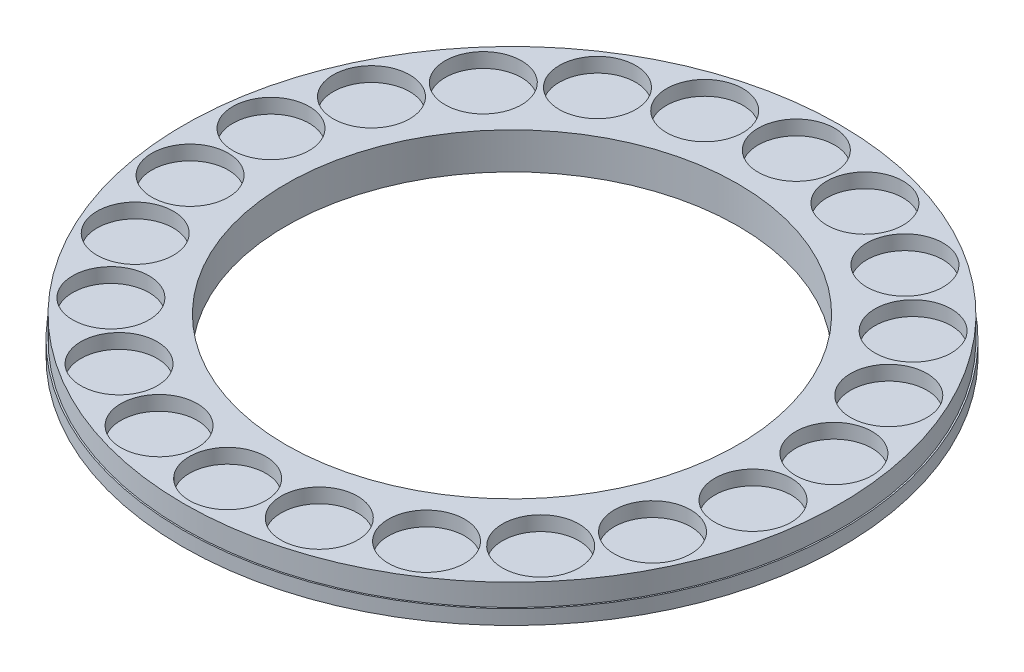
ISO-10303-21;
HEADER;
FILE_DESCRIPTION(('STEP AP214'),'2;1');
FILE_NAME('part.step','',(''),(''),'','','');
FILE_SCHEMA(('AUTOMOTIVE_DESIGN { 1 0 10303 214 1 1 1 1 }'));
ENDSEC;
DATA;
#1=APPLICATION_CONTEXT('core data for automotive mechanical design processes');
#2=APPLICATION_PROTOCOL_DEFINITION('international standard','automotive_design',2000,#1);
#3=PRODUCT_CONTEXT('',#1,'mechanical');
#4=PRODUCT('Part','Part','',(#3));
#5=PRODUCT_RELATED_PRODUCT_CATEGORY('part','',(#4));
#6=PRODUCT_DEFINITION_FORMATION('','',#4);
#7=PRODUCT_DEFINITION_CONTEXT('part definition',#1,'design');
#8=PRODUCT_DEFINITION('design','',#6,#7);
#9=PRODUCT_DEFINITION_SHAPE('','',#8);
#10=(LENGTH_UNIT() NAMED_UNIT(*) SI_UNIT(.MILLI.,.METRE.));
#11=(NAMED_UNIT(*) PLANE_ANGLE_UNIT() SI_UNIT($,.RADIAN.));
#12=(NAMED_UNIT(*) SI_UNIT($,.STERADIAN.) SOLID_ANGLE_UNIT());
#13=UNCERTAINTY_MEASURE_WITH_UNIT(LENGTH_MEASURE(1.E-05),#10,'distance_accuracy_value','');
#14=(GEOMETRIC_REPRESENTATION_CONTEXT(3) GLOBAL_UNCERTAINTY_ASSIGNED_CONTEXT((#13)) GLOBAL_UNIT_ASSIGNED_CONTEXT((#10,
#11,#12)) REPRESENTATION_CONTEXT('',''));
#15=CARTESIAN_POINT('',(0.,0.,0.));
#16=DIRECTION('',(0.,0.,1.));
#17=DIRECTION('',(1.,0.,0.));
#18=AXIS2_PLACEMENT_3D('',#15,#16,#17);
#19=CARTESIAN_POINT('',(0.,19.05,0.));
#20=DIRECTION('',(0.,-1.,0.));
#21=DIRECTION('',(0.,0.,-1.));
#22=AXIS2_PLACEMENT_3D('',#19,#20,#21);
#23=CYLINDRICAL_SURFACE('',#22,285.75);
#24=CARTESIAN_POINT('',(0.,19.05,0.));
#25=DIRECTION('',(0.,1.,0.));
#26=DIRECTION('',(0.,0.,1.));
#27=AXIS2_PLACEMENT_3D('',#24,#25,#26);
#28=CIRCLE('',#27,285.75);
#29=CARTESIAN_POINT('',(0.,19.05,-285.75));
#30=VERTEX_POINT('',#29);
#31=EDGE_CURVE('E10',#30,#30,#28,.T.);
#32=CARTESIAN_POINT('',(0.,0.,0.));
#33=DIRECTION('',(0.,-1.,0.));
#34=DIRECTION('',(0.,0.,-1.));
#35=AXIS2_PLACEMENT_3D('',#32,#33,#34);
#36=CIRCLE('',#35,285.75);
#37=CARTESIAN_POINT('',(0.,0.,-285.75));
#38=VERTEX_POINT('',#37);
#39=EDGE_CURVE('E30',#38,#38,#36,.T.);
#40=CARTESIAN_POINT('',(0.,19.05,-285.75));
#41=CARTESIAN_POINT('',(0.,18.8515625,-285.75));
#42=CARTESIAN_POINT('',(0.,18.653125,-285.75));
#43=CARTESIAN_POINT('',(0.,18.25625,-285.75));
#44=CARTESIAN_POINT('',(0.,18.0578125,-285.75));
#45=CARTESIAN_POINT('',(0.,17.6609375,-285.75));
#46=CARTESIAN_POINT('',(0.,17.4625,-285.75));
#47=CARTESIAN_POINT('',(0.,17.065625,-285.75));
#48=CARTESIAN_POINT('',(0.,16.8671875,-285.75));
#49=CARTESIAN_POINT('',(0.,16.4703125,-285.75));
#50=CARTESIAN_POINT('',(0.,16.271875,-285.75));
#51=CARTESIAN_POINT('',(0.,15.875,-285.75));
#52=CARTESIAN_POINT('',(0.,15.6765625,-285.75));
#53=CARTESIAN_POINT('',(0.,15.2796875,-285.75));
#54=CARTESIAN_POINT('',(0.,15.08125,-285.75));
#55=CARTESIAN_POINT('',(0.,14.684375,-285.75));
#56=CARTESIAN_POINT('',(0.,14.4859375,-285.75));
#57=CARTESIAN_POINT('',(0.,14.0890625,-285.75));
#58=CARTESIAN_POINT('',(0.,13.890625,-285.75));
#59=CARTESIAN_POINT('',(0.,13.49375,-285.75));
#60=CARTESIAN_POINT('',(0.,13.2953125,-285.75));
#61=CARTESIAN_POINT('',(0.,12.8984375,-285.75));
#62=CARTESIAN_POINT('',(0.,12.7,-285.75));
#63=CARTESIAN_POINT('',(0.,12.303125,-285.75));
#64=CARTESIAN_POINT('',(0.,12.1046875,-285.75));
#65=CARTESIAN_POINT('',(0.,11.7078125,-285.75));
#66=CARTESIAN_POINT('',(0.,11.509375,-285.75));
#67=CARTESIAN_POINT('',(0.,11.1125,-285.75));
#68=CARTESIAN_POINT('',(0.,10.9140625,-285.75));
#69=CARTESIAN_POINT('',(0.,10.5171875,-285.75));
#70=CARTESIAN_POINT('',(0.,10.31875,-285.75));
#71=CARTESIAN_POINT('',(0.,9.921875,-285.75));
#72=CARTESIAN_POINT('',(0.,9.7234375,-285.75));
#73=CARTESIAN_POINT('',(0.,9.3265625,-285.75));
#74=CARTESIAN_POINT('',(0.,9.128125,-285.75));
#75=CARTESIAN_POINT('',(0.,8.73125,-285.75));
#76=CARTESIAN_POINT('',(0.,8.5328125,-285.75));
#77=CARTESIAN_POINT('',(0.,8.1359375,-285.75));
#78=CARTESIAN_POINT('',(0.,7.9375,-285.75));
#79=CARTESIAN_POINT('',(0.,7.540625,-285.75));
#80=CARTESIAN_POINT('',(0.,7.3421875,-285.75));
#81=CARTESIAN_POINT('',(0.,6.9453125,-285.75));
#82=CARTESIAN_POINT('',(0.,6.746875,-285.75));
#83=CARTESIAN_POINT('',(0.,6.35,-285.75));
#84=CARTESIAN_POINT('',(0.,6.1515625,-285.75));
#85=CARTESIAN_POINT('',(0.,5.7546875,-285.75));
#86=CARTESIAN_POINT('',(0.,5.55625,-285.75));
#87=CARTESIAN_POINT('',(0.,5.159375,-285.75));
#88=CARTESIAN_POINT('',(0.,4.9609375,-285.75));
#89=CARTESIAN_POINT('',(0.,4.5640625,-285.75));
#90=CARTESIAN_POINT('',(0.,4.365625,-285.75));
#91=CARTESIAN_POINT('',(0.,3.96875,-285.75));
#92=CARTESIAN_POINT('',(0.,3.7703125,-285.75));
#93=CARTESIAN_POINT('',(0.,3.3734375,-285.75));
#94=CARTESIAN_POINT('',(0.,3.175,-285.75));
#95=CARTESIAN_POINT('',(0.,2.778125,-285.75));
#96=CARTESIAN_POINT('',(0.,2.5796875,-285.75));
#97=CARTESIAN_POINT('',(0.,2.1828125,-285.75));
#98=CARTESIAN_POINT('',(0.,1.984375,-285.75));
#99=CARTESIAN_POINT('',(0.,1.5875,-285.75));
#100=CARTESIAN_POINT('',(0.,1.3890625,-285.75));
#101=CARTESIAN_POINT('',(0.,0.992187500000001,-285.75));
#102=CARTESIAN_POINT('',(0.,0.793750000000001,-285.75));
#103=CARTESIAN_POINT('',(0.,0.396875,-285.75));
#104=CARTESIAN_POINT('',(0.,0.1984375,-285.75));
#105=CARTESIAN_POINT('',(0.,0.,-285.75));
#106=B_SPLINE_CURVE_WITH_KNOTS('',3,(#40,#41,#42,#43,#44,#45,#46,#47,#48,#49,#50,#51,#52,#53,
#54,#55,#56,#57,#58,#59,#60,#61,#62,#63,#64,#65,#66,#67,#68,#69,#70,#71,#72,#73,#74,#75,#76,#77,
#78,#79,#80,#81,#82,#83,#84,#85,#86,#87,#88,#89,#90,#91,#92,#93,#94,#95,#96,#97,#98,#99,#100,
#101,#102,#103,#104,#105),.UNSPECIFIED.,.F.,.F.,(4,2,2,2,2,2,2,2,2,2,2,2,2,2,2,2,2,2,2,2,2,2,2,
2,2,2,2,2,2,2,2,2,4),(0.,0.5953125,1.190625,1.7859375,2.38125,2.9765625,3.571875,4.1671875,
4.7625,5.3578125,5.953125,6.5484375,7.14375,7.7390625,8.334375,8.9296875,9.525,10.1203125,
10.715625,11.3109375,11.90625,12.5015625,13.096875,13.6921875,14.2875,14.8828125,15.478125,
16.0734375,16.66875,17.2640625,17.859375,18.4546875,19.05),.UNSPECIFIED.);
#107=EDGE_CURVE('BSEAM24',#30,#38,#106,.T.);
#108=ORIENTED_EDGE('',*,*,#31,.F.);
#109=ORIENTED_EDGE('',*,*,#39,.F.);
#110=ORIENTED_EDGE('',*,*,#107,.T.);
#111=ORIENTED_EDGE('',*,*,#107,.F.);
#112=EDGE_LOOP('',(#108,#110,#109,#111));
#113=FACE_BOUND('',#112,.T.);
#114=ADVANCED_FACE('F24',(#113),#23,.T.);
#115=CARTESIAN_POINT('',(0.,19.05,0.));
#116=DIRECTION('',(0.,1.,0.));
#117=DIRECTION('',(0.,0.,1.));
#118=AXIS2_PLACEMENT_3D('',#115,#116,#117);
#119=PLANE('',#118);
#120=CARTESIAN_POINT('',(0.,19.05,0.));
#121=DIRECTION('',(0.,1.,0.));
#122=DIRECTION('',(0.,0.,1.));
#123=AXIS2_PLACEMENT_3D('',#120,#121,#122);
#124=CIRCLE('',#123,196.85);
#125=CARTESIAN_POINT('',(0.,19.05,196.85));
#126=VERTEX_POINT('',#125);
#127=EDGE_CURVE('E178',#126,#126,#124,.T.);
#128=ORIENTED_EDGE('',*,*,#127,.F.);
#129=EDGE_LOOP('',(#128));
#130=FACE_BOUND('',#129,.T.);
#131=CARTESIAN_POINT('',(-69.7710677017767,19.05,237.618434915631));
#132=DIRECTION('',(0.,1.,0.));
#133=DIRECTION('',(-0.281732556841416,0.,0.959492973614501));
#134=AXIS2_PLACEMENT_3D('',#131,#132,#133);
#135=CIRCLE('',#134,33.274);
#136=CARTESIAN_POINT('',(-79.145436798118,19.05,269.54460411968));
#137=VERTEX_POINT('',#136);
#138=EDGE_CURVE('E172',#137,#137,#135,.T.);
#139=ORIENTED_EDGE('',*,*,#138,.F.);
#140=EDGE_LOOP('',(#139));
#141=FACE_BOUND('',#140,.T.);
#142=CARTESIAN_POINT('',(-133.889698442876,19.05,208.336437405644));
#143=DIRECTION('',(0.,1.,0.));
#144=DIRECTION('',(-0.540640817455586,0.,0.841253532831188));
#145=AXIS2_PLACEMENT_3D('',#142,#143,#144);
#146=CIRCLE('',#145,33.274);
#147=CARTESIAN_POINT('',(-151.878981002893,19.05,236.328307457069));
#148=VERTEX_POINT('',#147);
#149=EDGE_CURVE('E166',#148,#148,#146,.T.);
#150=ORIENTED_EDGE('',*,*,#149,.F.);
#151=EDGE_LOOP('',(#150));
#152=FACE_BOUND('',#151,.T.);
#153=CARTESIAN_POINT('',(-187.16138208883,19.05,162.176260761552));
#154=DIRECTION('',(0.,1.,0.));
#155=DIRECTION('',(-0.75574957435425,0.,0.654860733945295));
#156=AXIS2_PLACEMENT_3D('',#153,#154,#155);
#157=CIRCLE('',#156,33.274);
#158=CARTESIAN_POINT('',(-212.308193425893,19.05,183.966096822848));
#159=VERTEX_POINT('',#158);
#160=EDGE_CURVE('E160',#159,#159,#157,.T.);
#161=ORIENTED_EDGE('',*,*,#160,.F.);
#162=EDGE_LOOP('',(#161));
#163=FACE_BOUND('',#162,.T.);
#164=CARTESIAN_POINT('',(-225.270363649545,19.05,102.87752796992));
#165=DIRECTION('',(0.,1.,0.));
#166=DIRECTION('',(-0.909631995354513,0.,0.415415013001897));
#167=AXIS2_PLACEMENT_3D('',#164,#165,#166);
#168=CIRCLE('',#167,33.274);
#169=CARTESIAN_POINT('',(-255.537458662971,19.05,116.700047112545));
#170=VERTEX_POINT('',#169);
#171=EDGE_CURVE('E154',#170,#170,#168,.T.);
#172=ORIENTED_EDGE('',*,*,#171,.F.);
#173=EDGE_LOOP('',(#172));
#174=FACE_BOUND('',#173,.T.);
#175=CARTESIAN_POINT('',(-245.129280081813,19.05,35.2442696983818));
#176=DIRECTION('',(0.,1.,0.));
#177=DIRECTION('',(-0.989821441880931,0.,0.142314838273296));
#178=AXIS2_PLACEMENT_3D('',#175,#176,#177);
#179=CIRCLE('',#178,33.274);
#180=CARTESIAN_POINT('',(-278.064598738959,19.05,39.9796536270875));
#181=VERTEX_POINT('',#180);
#182=EDGE_CURVE('E148',#181,#181,#179,.T.);
#183=ORIENTED_EDGE('',*,*,#182,.F.);
#184=EDGE_LOOP('',(#183));
#185=FACE_BOUND('',#184,.T.);
#186=CARTESIAN_POINT('',(-245.129280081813,19.05,-35.2442696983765));
#187=DIRECTION('',(0.,1.,0.));
#188=DIRECTION('',(-0.989821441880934,0.,-0.142314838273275));
#189=AXIS2_PLACEMENT_3D('',#186,#187,#188);
#190=CIRCLE('',#189,33.274);
#191=CARTESIAN_POINT('',(-278.06459873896,19.05,-39.9796536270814));
#192=VERTEX_POINT('',#191);
#193=EDGE_CURVE('E142',#192,#192,#190,.T.);
#194=ORIENTED_EDGE('',*,*,#193,.F.);
#195=EDGE_LOOP('',(#194));
#196=FACE_BOUND('',#195,.T.);
#197=CARTESIAN_POINT('',(-225.270363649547,19.05,-102.877527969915));
#198=DIRECTION('',(0.,1.,0.));
#199=DIRECTION('',(-0.909631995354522,0.,-0.415415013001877));
#200=AXIS2_PLACEMENT_3D('',#197,#198,#199);
#201=CIRCLE('',#200,33.274);
#202=CARTESIAN_POINT('',(-255.537458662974,19.05,-116.700047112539));
#203=VERTEX_POINT('',#202);
#204=EDGE_CURVE('E136',#203,#203,#201,.T.);
#205=ORIENTED_EDGE('',*,*,#204,.F.);
#206=EDGE_LOOP('',(#205));
#207=FACE_BOUND('',#206,.T.);
#208=CARTESIAN_POINT('',(-187.161382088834,19.05,-162.176260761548));
#209=DIRECTION('',(0.,1.,0.));
#210=DIRECTION('',(-0.755749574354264,0.,-0.654860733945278));
#211=AXIS2_PLACEMENT_3D('',#208,#209,#210);
#212=CIRCLE('',#211,33.274);
#213=CARTESIAN_POINT('',(-212.308193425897,19.05,-183.966096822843));
#214=VERTEX_POINT('',#213);
#215=EDGE_CURVE('E130',#214,#214,#212,.T.);
#216=ORIENTED_EDGE('',*,*,#215,.F.);
#217=EDGE_LOOP('',(#216));
#218=FACE_BOUND('',#217,.T.);
#219=CARTESIAN_POINT('',(-133.88969844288,19.05,-208.336437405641));
#220=DIRECTION('',(0.,1.,0.));
#221=DIRECTION('',(-0.540640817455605,0.,-0.841253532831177));
#222=AXIS2_PLACEMENT_3D('',#219,#220,#221);
#223=CIRCLE('',#222,33.274);
#224=CARTESIAN_POINT('',(-151.878981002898,19.05,-236.328307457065));
#225=VERTEX_POINT('',#224);
#226=EDGE_CURVE('E124',#225,#225,#223,.T.);
#227=ORIENTED_EDGE('',*,*,#226,.F.);
#228=EDGE_LOOP('',(#227));
#229=FACE_BOUND('',#228,.T.);
#230=CARTESIAN_POINT('',(-69.7710677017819,19.05,-237.61843491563));
#231=DIRECTION('',(0.,1.,0.));
#232=DIRECTION('',(-0.281732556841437,0.,-0.959492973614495));
#233=AXIS2_PLACEMENT_3D('',#230,#231,#232);
#234=CIRCLE('',#233,33.274);
#235=CARTESIAN_POINT('',(-79.1454367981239,19.05,-269.544604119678));
#236=VERTEX_POINT('',#235);
#237=EDGE_CURVE('E118',#236,#236,#234,.T.);
#238=ORIENTED_EDGE('',*,*,#237,.F.);
#239=EDGE_LOOP('',(#238));
#240=FACE_BOUND('',#239,.T.);
#241=CARTESIAN_POINT('',(-1.83931040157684E-12,19.05,-247.65));
#242=DIRECTION('',(0.,1.,0.));
#243=DIRECTION('',(0.,0.,-1.));
#244=AXIS2_PLACEMENT_3D('',#241,#242,#243);
#245=CIRCLE('',#244,33.274);
#246=CARTESIAN_POINT('',(-2.0864382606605E-12,19.05,-280.924));
#247=VERTEX_POINT('',#246);
#248=EDGE_CURVE('E112',#247,#247,#245,.T.);
#249=ORIENTED_EDGE('',*,*,#248,.F.);
#250=EDGE_LOOP('',(#249));
#251=FACE_BOUND('',#250,.T.);
#252=CARTESIAN_POINT('',(69.7710677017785,19.05,-237.618434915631));
#253=DIRECTION('',(0.,1.,0.));
#254=DIRECTION('',(0.281732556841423,0.,-0.959492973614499));
#255=AXIS2_PLACEMENT_3D('',#252,#253,#254);
#256=CIRCLE('',#255,33.274);
#257=CARTESIAN_POINT('',(79.14543679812,19.05,-269.54460411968));
#258=VERTEX_POINT('',#257);
#259=EDGE_CURVE('E106',#258,#258,#256,.T.);
#260=ORIENTED_EDGE('',*,*,#259,.F.);
#261=EDGE_LOOP('',(#260));
#262=FACE_BOUND('',#261,.T.);
#263=CARTESIAN_POINT('',(133.889698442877,19.05,-208.336437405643));
#264=DIRECTION('',(0.,1.,0.));
#265=DIRECTION('',(0.540640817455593,0.,-0.841253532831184));
#266=AXIS2_PLACEMENT_3D('',#263,#264,#265);
#267=CIRCLE('',#266,33.274);
#268=CARTESIAN_POINT('',(151.878981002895,19.05,-236.328307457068));
#269=VERTEX_POINT('',#268);
#270=EDGE_CURVE('E100',#269,#269,#267,.T.);
#271=ORIENTED_EDGE('',*,*,#270,.F.);
#272=EDGE_LOOP('',(#271));
#273=FACE_BOUND('',#272,.T.);
#274=CARTESIAN_POINT('',(187.161382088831,19.05,-162.176260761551));
#275=DIRECTION('',(0.,1.,0.));
#276=DIRECTION('',(0.755749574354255,0.,-0.654860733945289));
#277=AXIS2_PLACEMENT_3D('',#274,#275,#276);
#278=CIRCLE('',#277,33.274);
#279=CARTESIAN_POINT('',(212.308193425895,19.05,-183.966096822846));
#280=VERTEX_POINT('',#279);
#281=EDGE_CURVE('E94',#280,#280,#278,.T.);
#282=ORIENTED_EDGE('',*,*,#281,.F.);
#283=EDGE_LOOP('',(#282));
#284=FACE_BOUND('',#283,.T.);
#285=CARTESIAN_POINT('',(225.270363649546,19.05,-102.877527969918));
#286=DIRECTION('',(0.,1.,0.));
#287=DIRECTION('',(0.909631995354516,0.,-0.415415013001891));
#288=AXIS2_PLACEMENT_3D('',#285,#286,#287);
#289=CIRCLE('',#288,33.274);
#290=CARTESIAN_POINT('',(255.537458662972,19.05,-116.700047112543));
#291=VERTEX_POINT('',#290);
#292=EDGE_CURVE('E88',#291,#291,#289,.T.);
#293=ORIENTED_EDGE('',*,*,#292,.F.);
#294=EDGE_LOOP('',(#293));
#295=FACE_BOUND('',#294,.T.);
#296=CARTESIAN_POINT('',(245.129280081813,19.05,-35.24426969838));
#297=DIRECTION('',(0.,1.,0.));
#298=DIRECTION('',(0.989821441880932,0.,-0.142314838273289));
#299=AXIS2_PLACEMENT_3D('',#296,#297,#298);
#300=CIRCLE('',#299,33.274);
#301=CARTESIAN_POINT('',(278.064598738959,19.05,-39.9796536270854));
#302=VERTEX_POINT('',#301);
#303=EDGE_CURVE('E82',#302,#302,#300,.T.);
#304=ORIENTED_EDGE('',*,*,#303,.F.);
#305=EDGE_LOOP('',(#304));
#306=FACE_BOUND('',#305,.T.);
#307=CARTESIAN_POINT('',(245.129280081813,19.05,35.2442696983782));
#308=DIRECTION('',(0.,1.,0.));
#309=DIRECTION('',(0.989821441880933,0.,0.142314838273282));
#310=AXIS2_PLACEMENT_3D('',#307,#308,#309);
#311=CIRCLE('',#310,33.274);
#312=CARTESIAN_POINT('',(278.064598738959,19.05,39.9796536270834));
#313=VERTEX_POINT('',#312);
#314=EDGE_CURVE('E76',#313,#313,#311,.T.);
#315=ORIENTED_EDGE('',*,*,#314,.F.);
#316=EDGE_LOOP('',(#315));
#317=FACE_BOUND('',#316,.T.);
#318=CARTESIAN_POINT('',(225.270363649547,19.05,102.877527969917));
#319=DIRECTION('',(0.,1.,0.));
#320=DIRECTION('',(0.909631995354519,0.,0.415415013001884));
#321=AXIS2_PLACEMENT_3D('',#318,#319,#320);
#322=CIRCLE('',#321,33.274);
#323=CARTESIAN_POINT('',(255.537458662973,19.05,116.700047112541));
#324=VERTEX_POINT('',#323);
#325=EDGE_CURVE('E70',#324,#324,#322,.T.);
#326=ORIENTED_EDGE('',*,*,#325,.F.);
#327=EDGE_LOOP('',(#326));
#328=FACE_BOUND('',#327,.T.);
#329=CARTESIAN_POINT('',(187.161382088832,19.05,162.176260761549));
#330=DIRECTION('',(0.,1.,0.));
#331=DIRECTION('',(0.755749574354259,0.,0.654860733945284));
#332=AXIS2_PLACEMENT_3D('',#329,#330,#331);
#333=CIRCLE('',#332,33.274);
#334=CARTESIAN_POINT('',(212.308193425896,19.05,183.966096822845));
#335=VERTEX_POINT('',#334);
#336=EDGE_CURVE('E64',#335,#335,#333,.T.);
#337=ORIENTED_EDGE('',*,*,#336,.F.);
#338=EDGE_LOOP('',(#337));
#339=FACE_BOUND('',#338,.T.);
#340=CARTESIAN_POINT('',(133.889698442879,19.05,208.336437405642));
#341=DIRECTION('',(0.,1.,0.));
#342=DIRECTION('',(0.540640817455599,0.,0.841253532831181));
#343=AXIS2_PLACEMENT_3D('',#340,#341,#342);
#344=CIRCLE('',#343,33.274);
#345=CARTESIAN_POINT('',(151.878981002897,19.05,236.328307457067));
#346=VERTEX_POINT('',#345);
#347=EDGE_CURVE('E58',#346,#346,#344,.T.);
#348=ORIENTED_EDGE('',*,*,#347,.F.);
#349=EDGE_LOOP('',(#348));
#350=FACE_BOUND('',#349,.T.);
#351=CARTESIAN_POINT('',(69.7710677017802,19.05,237.61843491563));
#352=DIRECTION('',(0.,1.,0.));
#353=DIRECTION('',(0.28173255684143,0.,0.959492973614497));
#354=AXIS2_PLACEMENT_3D('',#351,#352,#353);
#355=CIRCLE('',#354,33.274);
#356=CARTESIAN_POINT('',(79.145436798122,19.05,269.544604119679));
#357=VERTEX_POINT('',#356);
#358=EDGE_CURVE('E52',#357,#357,#355,.T.);
#359=ORIENTED_EDGE('',*,*,#358,.F.);
#360=EDGE_LOOP('',(#359));
#361=FACE_BOUND('',#360,.T.);
#362=CARTESIAN_POINT('',(0.,19.05,247.65));
#363=DIRECTION('',(0.,1.,0.));
#364=DIRECTION('',(0.,0.,1.));
#365=AXIS2_PLACEMENT_3D('',#362,#363,#364);
#366=CIRCLE('',#365,33.274);
#367=CARTESIAN_POINT('',(0.,19.05,280.924));
#368=VERTEX_POINT('',#367);
#369=EDGE_CURVE('E46',#368,#368,#366,.T.);
#370=ORIENTED_EDGE('',*,*,#369,.F.);
#371=EDGE_LOOP('',(#370));
#372=FACE_BOUND('',#371,.T.);
#373=ORIENTED_EDGE('',*,*,#31,.T.);
#374=EDGE_LOOP('',(#373));
#375=FACE_BOUND('',#374,.T.);
#376=ADVANCED_FACE('F184',(#130,#141,#152,#163,#174,#185,#196,#207,#218,#229,#240,#251,#262,
#273,#284,#295,#306,#317,#328,#339,#350,#361,#372,#375),#119,.T.);
#377=CARTESIAN_POINT('',(0.,0.,0.));
#378=DIRECTION('',(0.,-1.,0.));
#379=DIRECTION('',(0.,0.,-1.));
#380=AXIS2_PLACEMENT_3D('',#377,#378,#379);
#381=PLANE('',#380);
#382=CARTESIAN_POINT('',(0.,0.,0.));
#383=DIRECTION('',(0.,-1.,0.));
#384=DIRECTION('',(0.,0.,-1.));
#385=AXIS2_PLACEMENT_3D('',#382,#383,#384);
#386=CIRCLE('',#385,287.02);
#387=CARTESIAN_POINT('',(0.,0.,-287.02));
#388=VERTEX_POINT('',#387);
#389=EDGE_CURVE('E38',#388,#388,#386,.T.);
#390=ORIENTED_EDGE('',*,*,#389,.F.);
#391=EDGE_LOOP('',(#390));
#392=FACE_BOUND('',#391,.T.);
#393=ORIENTED_EDGE('',*,*,#39,.T.);
#394=EDGE_LOOP('',(#393));
#395=FACE_BOUND('',#394,.T.);
#396=ADVANCED_FACE('F187',(#392,#395),#381,.F.);
#397=CARTESIAN_POINT('',(0.,-12.7,0.));
#398=DIRECTION('',(0.,1.,0.));
#399=DIRECTION('',(0.,0.,1.));
#400=AXIS2_PLACEMENT_3D('',#397,#398,#399);
#401=CYLINDRICAL_SURFACE('',#400,287.02);
#402=CARTESIAN_POINT('',(0.,-12.7,0.));
#403=DIRECTION('',(0.,-1.,0.));
#404=DIRECTION('',(0.,0.,-1.));
#405=AXIS2_PLACEMENT_3D('',#402,#403,#404);
#406=CIRCLE('',#405,287.02);
#407=CARTESIAN_POINT('',(0.,-12.7,-287.02));
#408=VERTEX_POINT('',#407);
#409=EDGE_CURVE('E34',#408,#408,#406,.T.);
#410=ORIENTED_EDGE('',*,*,#409,.F.);
#411=EDGE_LOOP('',(#410));
#412=FACE_BOUND('',#411,.T.);
#413=ORIENTED_EDGE('',*,*,#389,.T.);
#414=EDGE_LOOP('',(#413));
#415=FACE_BOUND('',#414,.T.);
#416=ADVANCED_FACE('F246',(#412,#415),#401,.T.);
#417=CARTESIAN_POINT('',(0.,-12.7,0.));
#418=DIRECTION('',(0.,-1.,0.));
#419=DIRECTION('',(0.,0.,-1.));
#420=AXIS2_PLACEMENT_3D('',#417,#418,#419);
#421=PLANE('',#420);
#422=CARTESIAN_POINT('',(0.,-12.7,0.));
#423=DIRECTION('',(0.,1.,0.));
#424=DIRECTION('',(0.,0.,1.));
#425=AXIS2_PLACEMENT_3D('',#422,#423,#424);
#426=CIRCLE('',#425,196.85);
#427=CARTESIAN_POINT('',(0.,-12.7,196.85));
#428=VERTEX_POINT('',#427);
#429=EDGE_CURVE('E175',#428,#428,#426,.T.);
#430=ORIENTED_EDGE('',*,*,#429,.T.);
#431=EDGE_LOOP('',(#430));
#432=FACE_BOUND('',#431,.T.);
#433=ORIENTED_EDGE('',*,*,#409,.T.);
#434=EDGE_LOOP('',(#433));
#435=FACE_BOUND('',#434,.T.);
#436=ADVANCED_FACE('F235',(#432,#435),#421,.T.);
#437=CARTESIAN_POINT('',(0.,6.35,247.65));
#438=DIRECTION('',(0.,1.,0.));
#439=DIRECTION('',(0.,0.,1.));
#440=AXIS2_PLACEMENT_3D('',#437,#438,#439);
#441=CYLINDRICAL_SURFACE('',#440,33.274);
#442=CARTESIAN_POINT('',(0.,6.35,247.65));
#443=DIRECTION('',(0.,1.,0.));
#444=DIRECTION('',(0.,0.,1.));
#445=AXIS2_PLACEMENT_3D('',#442,#443,#444);
#446=CIRCLE('',#445,33.274);
#447=CARTESIAN_POINT('',(0.,6.35,280.924));
#448=VERTEX_POINT('',#447);
#449=EDGE_CURVE('E43',#448,#448,#446,.T.);
#450=ORIENTED_EDGE('',*,*,#449,.F.);
#451=EDGE_LOOP('',(#450));
#452=FACE_BOUND('',#451,.T.);
#453=ORIENTED_EDGE('',*,*,#369,.T.);
#454=EDGE_LOOP('',(#453));
#455=FACE_BOUND('',#454,.T.);
#456=ADVANCED_FACE('F232',(#452,#455),#441,.F.);
#457=CARTESIAN_POINT('',(0.,6.35,247.65));
#458=DIRECTION('',(0.,1.,0.));
#459=DIRECTION('',(0.,0.,1.));
#460=AXIS2_PLACEMENT_3D('',#457,#458,#459);
#461=PLANE('',#460);
#462=ORIENTED_EDGE('',*,*,#449,.T.);
#463=EDGE_LOOP('',(#462));
#464=FACE_BOUND('',#463,.T.);
#465=ADVANCED_FACE('F234',(#464),#461,.T.);
#466=CARTESIAN_POINT('',(69.7710677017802,6.35,237.61843491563));
#467=DIRECTION('',(0.,1.,0.));
#468=DIRECTION('',(0.,0.,1.));
#469=AXIS2_PLACEMENT_3D('',#466,#467,#468);
#470=CYLINDRICAL_SURFACE('',#469,33.274);
#471=CARTESIAN_POINT('',(69.7710677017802,6.35,237.61843491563));
#472=DIRECTION('',(0.,1.,0.));
#473=DIRECTION('',(0.28173255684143,0.,0.959492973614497));
#474=AXIS2_PLACEMENT_3D('',#471,#472,#473);
#475=CIRCLE('',#474,33.274);
#476=CARTESIAN_POINT('',(79.145436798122,6.35,269.544604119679));
#477=VERTEX_POINT('',#476);
#478=EDGE_CURVE('E49',#477,#477,#475,.T.);
#479=ORIENTED_EDGE('',*,*,#478,.F.);
#480=EDGE_LOOP('',(#479));
#481=FACE_BOUND('',#480,.T.);
#482=ORIENTED_EDGE('',*,*,#358,.T.);
#483=EDGE_LOOP('',(#482));
#484=FACE_BOUND('',#483,.T.);
#485=ADVANCED_FACE('F242',(#481,#484),#470,.F.);
#486=CARTESIAN_POINT('',(69.7710677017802,6.35,237.61843491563));
#487=DIRECTION('',(0.,1.,0.));
#488=DIRECTION('',(0.28173255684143,0.,0.959492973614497));
#489=AXIS2_PLACEMENT_3D('',#486,#487,#488);
#490=PLANE('',#489);
#491=ORIENTED_EDGE('',*,*,#478,.T.);
#492=EDGE_LOOP('',(#491));
#493=FACE_BOUND('',#492,.T.);
#494=ADVANCED_FACE('F287',(#493),#490,.T.);
#495=CARTESIAN_POINT('',(133.889698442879,6.35,208.336437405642));
#496=DIRECTION('',(0.,1.,0.));
#497=DIRECTION('',(0.,0.,1.));
#498=AXIS2_PLACEMENT_3D('',#495,#496,#497);
#499=CYLINDRICAL_SURFACE('',#498,33.274);
#500=CARTESIAN_POINT('',(133.889698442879,6.35,208.336437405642));
#501=DIRECTION('',(0.,1.,0.));
#502=DIRECTION('',(0.540640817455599,0.,0.841253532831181));
#503=AXIS2_PLACEMENT_3D('',#500,#501,#502);
#504=CIRCLE('',#503,33.274);
#505=CARTESIAN_POINT('',(151.878981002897,6.35,236.328307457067));
#506=VERTEX_POINT('',#505);
#507=EDGE_CURVE('E55',#506,#506,#504,.T.);
#508=ORIENTED_EDGE('',*,*,#507,.F.);
#509=EDGE_LOOP('',(#508));
#510=FACE_BOUND('',#509,.T.);
#511=ORIENTED_EDGE('',*,*,#347,.T.);
#512=EDGE_LOOP('',(#511));
#513=FACE_BOUND('',#512,.T.);
#514=ADVANCED_FACE('F295',(#510,#513),#499,.F.);
#515=CARTESIAN_POINT('',(133.889698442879,6.35,208.336437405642));
#516=DIRECTION('',(0.,1.,0.));
#517=DIRECTION('',(0.540640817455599,0.,0.841253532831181));
#518=AXIS2_PLACEMENT_3D('',#515,#516,#517);
#519=PLANE('',#518);
#520=ORIENTED_EDGE('',*,*,#507,.T.);
#521=EDGE_LOOP('',(#520));
#522=FACE_BOUND('',#521,.T.);
#523=ADVANCED_FACE('F303',(#522),#519,.T.);
#524=CARTESIAN_POINT('',(187.161382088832,6.35,162.176260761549));
#525=DIRECTION('',(0.,1.,0.));
#526=DIRECTION('',(0.,0.,1.));
#527=AXIS2_PLACEMENT_3D('',#524,#525,#526);
#528=CYLINDRICAL_SURFACE('',#527,33.274);
#529=CARTESIAN_POINT('',(187.161382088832,6.35,162.176260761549));
#530=DIRECTION('',(0.,1.,0.));
#531=DIRECTION('',(0.755749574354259,0.,0.654860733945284));
#532=AXIS2_PLACEMENT_3D('',#529,#530,#531);
#533=CIRCLE('',#532,33.274);
#534=CARTESIAN_POINT('',(212.308193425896,6.35,183.966096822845));
#535=VERTEX_POINT('',#534);
#536=EDGE_CURVE('E61',#535,#535,#533,.T.);
#537=ORIENTED_EDGE('',*,*,#536,.F.);
#538=EDGE_LOOP('',(#537));
#539=FACE_BOUND('',#538,.T.);
#540=ORIENTED_EDGE('',*,*,#336,.T.);
#541=EDGE_LOOP('',(#540));
#542=FACE_BOUND('',#541,.T.);
#543=ADVANCED_FACE('F311',(#539,#542),#528,.F.);
#544=CARTESIAN_POINT('',(187.161382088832,6.35,162.176260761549));
#545=DIRECTION('',(0.,1.,0.));
#546=DIRECTION('',(0.755749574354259,0.,0.654860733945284));
#547=AXIS2_PLACEMENT_3D('',#544,#545,#546);
#548=PLANE('',#547);
#549=ORIENTED_EDGE('',*,*,#536,.T.);
#550=EDGE_LOOP('',(#549));
#551=FACE_BOUND('',#550,.T.);
#552=ADVANCED_FACE('F319',(#551),#548,.T.);
#553=CARTESIAN_POINT('',(225.270363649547,6.35,102.877527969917));
#554=DIRECTION('',(0.,1.,0.));
#555=DIRECTION('',(0.,0.,1.));
#556=AXIS2_PLACEMENT_3D('',#553,#554,#555);
#557=CYLINDRICAL_SURFACE('',#556,33.274);
#558=CARTESIAN_POINT('',(225.270363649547,6.35,102.877527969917));
#559=DIRECTION('',(0.,1.,0.));
#560=DIRECTION('',(0.909631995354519,0.,0.415415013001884));
#561=AXIS2_PLACEMENT_3D('',#558,#559,#560);
#562=CIRCLE('',#561,33.274);
#563=CARTESIAN_POINT('',(255.537458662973,6.35,116.700047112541));
#564=VERTEX_POINT('',#563);
#565=EDGE_CURVE('E67',#564,#564,#562,.T.);
#566=ORIENTED_EDGE('',*,*,#565,.F.);
#567=EDGE_LOOP('',(#566));
#568=FACE_BOUND('',#567,.T.);
#569=ORIENTED_EDGE('',*,*,#325,.T.);
#570=EDGE_LOOP('',(#569));
#571=FACE_BOUND('',#570,.T.);
#572=ADVANCED_FACE('F327',(#568,#571),#557,.F.);
#573=CARTESIAN_POINT('',(225.270363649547,6.35,102.877527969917));
#574=DIRECTION('',(0.,1.,0.));
#575=DIRECTION('',(0.909631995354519,0.,0.415415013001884));
#576=AXIS2_PLACEMENT_3D('',#573,#574,#575);
#577=PLANE('',#576);
#578=ORIENTED_EDGE('',*,*,#565,.T.);
#579=EDGE_LOOP('',(#578));
#580=FACE_BOUND('',#579,.T.);
#581=ADVANCED_FACE('F335',(#580),#577,.T.);
#582=CARTESIAN_POINT('',(245.129280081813,6.35,35.2442696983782));
#583=DIRECTION('',(0.,1.,0.));
#584=DIRECTION('',(0.,0.,1.));
#585=AXIS2_PLACEMENT_3D('',#582,#583,#584);
#586=CYLINDRICAL_SURFACE('',#585,33.274);
#587=CARTESIAN_POINT('',(245.129280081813,6.35,35.2442696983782));
#588=DIRECTION('',(0.,1.,0.));
#589=DIRECTION('',(0.989821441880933,0.,0.142314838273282));
#590=AXIS2_PLACEMENT_3D('',#587,#588,#589);
#591=CIRCLE('',#590,33.274);
#592=CARTESIAN_POINT('',(278.064598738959,6.35,39.9796536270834));
#593=VERTEX_POINT('',#592);
#594=EDGE_CURVE('E73',#593,#593,#591,.T.);
#595=ORIENTED_EDGE('',*,*,#594,.F.);
#596=EDGE_LOOP('',(#595));
#597=FACE_BOUND('',#596,.T.);
#598=ORIENTED_EDGE('',*,*,#314,.T.);
#599=EDGE_LOOP('',(#598));
#600=FACE_BOUND('',#599,.T.);
#601=ADVANCED_FACE('F343',(#597,#600),#586,.F.);
#602=CARTESIAN_POINT('',(245.129280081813,6.35,35.2442696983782));
#603=DIRECTION('',(0.,1.,0.));
#604=DIRECTION('',(0.989821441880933,0.,0.142314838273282));
#605=AXIS2_PLACEMENT_3D('',#602,#603,#604);
#606=PLANE('',#605);
#607=ORIENTED_EDGE('',*,*,#594,.T.);
#608=EDGE_LOOP('',(#607));
#609=FACE_BOUND('',#608,.T.);
#610=ADVANCED_FACE('F351',(#609),#606,.T.);
#611=CARTESIAN_POINT('',(245.129280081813,6.35,-35.24426969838));
#612=DIRECTION('',(0.,1.,0.));
#613=DIRECTION('',(0.,0.,1.));
#614=AXIS2_PLACEMENT_3D('',#611,#612,#613);
#615=CYLINDRICAL_SURFACE('',#614,33.274);
#616=CARTESIAN_POINT('',(245.129280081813,6.35,-35.24426969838));
#617=DIRECTION('',(0.,1.,0.));
#618=DIRECTION('',(0.989821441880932,0.,-0.142314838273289));
#619=AXIS2_PLACEMENT_3D('',#616,#617,#618);
#620=CIRCLE('',#619,33.274);
#621=CARTESIAN_POINT('',(278.064598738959,6.35,-39.9796536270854));
#622=VERTEX_POINT('',#621);
#623=EDGE_CURVE('E79',#622,#622,#620,.T.);
#624=ORIENTED_EDGE('',*,*,#623,.F.);
#625=EDGE_LOOP('',(#624));
#626=FACE_BOUND('',#625,.T.);
#627=ORIENTED_EDGE('',*,*,#303,.T.);
#628=EDGE_LOOP('',(#627));
#629=FACE_BOUND('',#628,.T.);
#630=ADVANCED_FACE('F359',(#626,#629),#615,.F.);
#631=CARTESIAN_POINT('',(245.129280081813,6.35,-35.24426969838));
#632=DIRECTION('',(0.,1.,0.));
#633=DIRECTION('',(0.989821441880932,0.,-0.142314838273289));
#634=AXIS2_PLACEMENT_3D('',#631,#632,#633);
#635=PLANE('',#634);
#636=ORIENTED_EDGE('',*,*,#623,.T.);
#637=EDGE_LOOP('',(#636));
#638=FACE_BOUND('',#637,.T.);
#639=ADVANCED_FACE('F367',(#638),#635,.T.);
#640=CARTESIAN_POINT('',(225.270363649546,6.35,-102.877527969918));
#641=DIRECTION('',(0.,1.,0.));
#642=DIRECTION('',(0.,0.,1.));
#643=AXIS2_PLACEMENT_3D('',#640,#641,#642);
#644=CYLINDRICAL_SURFACE('',#643,33.274);
#645=CARTESIAN_POINT('',(225.270363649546,6.35,-102.877527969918));
#646=DIRECTION('',(0.,1.,0.));
#647=DIRECTION('',(0.909631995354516,0.,-0.415415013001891));
#648=AXIS2_PLACEMENT_3D('',#645,#646,#647);
#649=CIRCLE('',#648,33.274);
#650=CARTESIAN_POINT('',(255.537458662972,6.35,-116.700047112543));
#651=VERTEX_POINT('',#650);
#652=EDGE_CURVE('E85',#651,#651,#649,.T.);
#653=ORIENTED_EDGE('',*,*,#652,.F.);
#654=EDGE_LOOP('',(#653));
#655=FACE_BOUND('',#654,.T.);
#656=ORIENTED_EDGE('',*,*,#292,.T.);
#657=EDGE_LOOP('',(#656));
#658=FACE_BOUND('',#657,.T.);
#659=ADVANCED_FACE('F375',(#655,#658),#644,.F.);
#660=CARTESIAN_POINT('',(225.270363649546,6.35,-102.877527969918));
#661=DIRECTION('',(0.,1.,0.));
#662=DIRECTION('',(0.909631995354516,0.,-0.415415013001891));
#663=AXIS2_PLACEMENT_3D('',#660,#661,#662);
#664=PLANE('',#663);
#665=ORIENTED_EDGE('',*,*,#652,.T.);
#666=EDGE_LOOP('',(#665));
#667=FACE_BOUND('',#666,.T.);
#668=ADVANCED_FACE('F383',(#667),#664,.T.);
#669=CARTESIAN_POINT('',(187.161382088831,6.35,-162.176260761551));
#670=DIRECTION('',(0.,1.,0.));
#671=DIRECTION('',(0.,0.,1.));
#672=AXIS2_PLACEMENT_3D('',#669,#670,#671);
#673=CYLINDRICAL_SURFACE('',#672,33.274);
#674=CARTESIAN_POINT('',(187.161382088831,6.35,-162.176260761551));
#675=DIRECTION('',(0.,1.,0.));
#676=DIRECTION('',(0.755749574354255,0.,-0.654860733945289));
#677=AXIS2_PLACEMENT_3D('',#674,#675,#676);
#678=CIRCLE('',#677,33.274);
#679=CARTESIAN_POINT('',(212.308193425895,6.35,-183.966096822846));
#680=VERTEX_POINT('',#679);
#681=EDGE_CURVE('E91',#680,#680,#678,.T.);
#682=ORIENTED_EDGE('',*,*,#681,.F.);
#683=EDGE_LOOP('',(#682));
#684=FACE_BOUND('',#683,.T.);
#685=ORIENTED_EDGE('',*,*,#281,.T.);
#686=EDGE_LOOP('',(#685));
#687=FACE_BOUND('',#686,.T.);
#688=ADVANCED_FACE('F391',(#684,#687),#673,.F.);
#689=CARTESIAN_POINT('',(187.161382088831,6.35,-162.176260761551));
#690=DIRECTION('',(0.,1.,0.));
#691=DIRECTION('',(0.755749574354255,0.,-0.654860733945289));
#692=AXIS2_PLACEMENT_3D('',#689,#690,#691);
#693=PLANE('',#692);
#694=ORIENTED_EDGE('',*,*,#681,.T.);
#695=EDGE_LOOP('',(#694));
#696=FACE_BOUND('',#695,.T.);
#697=ADVANCED_FACE('F399',(#696),#693,.T.);
#698=CARTESIAN_POINT('',(133.889698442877,6.35,-208.336437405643));
#699=DIRECTION('',(0.,1.,0.));
#700=DIRECTION('',(0.,0.,1.));
#701=AXIS2_PLACEMENT_3D('',#698,#699,#700);
#702=CYLINDRICAL_SURFACE('',#701,33.274);
#703=CARTESIAN_POINT('',(133.889698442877,6.35,-208.336437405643));
#704=DIRECTION('',(0.,1.,0.));
#705=DIRECTION('',(0.540640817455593,0.,-0.841253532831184));
#706=AXIS2_PLACEMENT_3D('',#703,#704,#705);
#707=CIRCLE('',#706,33.274);
#708=CARTESIAN_POINT('',(151.878981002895,6.35,-236.328307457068));
#709=VERTEX_POINT('',#708);
#710=EDGE_CURVE('E97',#709,#709,#707,.T.);
#711=ORIENTED_EDGE('',*,*,#710,.F.);
#712=EDGE_LOOP('',(#711));
#713=FACE_BOUND('',#712,.T.);
#714=ORIENTED_EDGE('',*,*,#270,.T.);
#715=EDGE_LOOP('',(#714));
#716=FACE_BOUND('',#715,.T.);
#717=ADVANCED_FACE('F407',(#713,#716),#702,.F.);
#718=CARTESIAN_POINT('',(133.889698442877,6.35,-208.336437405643));
#719=DIRECTION('',(0.,1.,0.));
#720=DIRECTION('',(0.540640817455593,0.,-0.841253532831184));
#721=AXIS2_PLACEMENT_3D('',#718,#719,#720);
#722=PLANE('',#721);
#723=ORIENTED_EDGE('',*,*,#710,.T.);
#724=EDGE_LOOP('',(#723));
#725=FACE_BOUND('',#724,.T.);
#726=ADVANCED_FACE('F415',(#725),#722,.T.);
#727=CARTESIAN_POINT('',(69.7710677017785,6.35,-237.618434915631));
#728=DIRECTION('',(0.,1.,0.));
#729=DIRECTION('',(0.,0.,1.));
#730=AXIS2_PLACEMENT_3D('',#727,#728,#729);
#731=CYLINDRICAL_SURFACE('',#730,33.274);
#732=CARTESIAN_POINT('',(69.7710677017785,6.35,-237.618434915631));
#733=DIRECTION('',(0.,1.,0.));
#734=DIRECTION('',(0.281732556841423,0.,-0.959492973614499));
#735=AXIS2_PLACEMENT_3D('',#732,#733,#734);
#736=CIRCLE('',#735,33.274);
#737=CARTESIAN_POINT('',(79.14543679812,6.35,-269.54460411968));
#738=VERTEX_POINT('',#737);
#739=EDGE_CURVE('E103',#738,#738,#736,.T.);
#740=ORIENTED_EDGE('',*,*,#739,.F.);
#741=EDGE_LOOP('',(#740));
#742=FACE_BOUND('',#741,.T.);
#743=ORIENTED_EDGE('',*,*,#259,.T.);
#744=EDGE_LOOP('',(#743));
#745=FACE_BOUND('',#744,.T.);
#746=ADVANCED_FACE('F423',(#742,#745),#731,.F.);
#747=CARTESIAN_POINT('',(69.7710677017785,6.35,-237.618434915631));
#748=DIRECTION('',(0.,1.,0.));
#749=DIRECTION('',(0.281732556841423,0.,-0.959492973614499));
#750=AXIS2_PLACEMENT_3D('',#747,#748,#749);
#751=PLANE('',#750);
#752=ORIENTED_EDGE('',*,*,#739,.T.);
#753=EDGE_LOOP('',(#752));
#754=FACE_BOUND('',#753,.T.);
#755=ADVANCED_FACE('F431',(#754),#751,.T.);
#756=CARTESIAN_POINT('',(-1.83931040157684E-12,6.35,-247.65));
#757=DIRECTION('',(0.,1.,0.));
#758=DIRECTION('',(0.,0.,1.));
#759=AXIS2_PLACEMENT_3D('',#756,#757,#758);
#760=CYLINDRICAL_SURFACE('',#759,33.274);
#761=CARTESIAN_POINT('',(-1.83931040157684E-12,6.35,-247.65));
#762=DIRECTION('',(0.,1.,0.));
#763=DIRECTION('',(0.,0.,-1.));
#764=AXIS2_PLACEMENT_3D('',#761,#762,#763);
#765=CIRCLE('',#764,33.274);
#766=CARTESIAN_POINT('',(-2.0864382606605E-12,6.35,-280.924));
#767=VERTEX_POINT('',#766);
#768=EDGE_CURVE('E109',#767,#767,#765,.T.);
#769=ORIENTED_EDGE('',*,*,#768,.F.);
#770=EDGE_LOOP('',(#769));
#771=FACE_BOUND('',#770,.T.);
#772=ORIENTED_EDGE('',*,*,#248,.T.);
#773=EDGE_LOOP('',(#772));
#774=FACE_BOUND('',#773,.T.);
#775=ADVANCED_FACE('F439',(#771,#774),#760,.F.);
#776=CARTESIAN_POINT('',(-1.83931040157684E-12,6.35,-247.65));
#777=DIRECTION('',(0.,1.,0.));
#778=DIRECTION('',(0.,0.,-1.));
#779=AXIS2_PLACEMENT_3D('',#776,#777,#778);
#780=PLANE('',#779);
#781=ORIENTED_EDGE('',*,*,#768,.T.);
#782=EDGE_LOOP('',(#781));
#783=FACE_BOUND('',#782,.T.);
#784=ADVANCED_FACE('F447',(#783),#780,.T.);
#785=CARTESIAN_POINT('',(-69.7710677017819,6.35,-237.61843491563));
#786=DIRECTION('',(0.,1.,0.));
#787=DIRECTION('',(0.,0.,1.));
#788=AXIS2_PLACEMENT_3D('',#785,#786,#787);
#789=CYLINDRICAL_SURFACE('',#788,33.274);
#790=CARTESIAN_POINT('',(-69.7710677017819,6.35,-237.61843491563));
#791=DIRECTION('',(0.,1.,0.));
#792=DIRECTION('',(-0.281732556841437,0.,-0.959492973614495));
#793=AXIS2_PLACEMENT_3D('',#790,#791,#792);
#794=CIRCLE('',#793,33.274);
#795=CARTESIAN_POINT('',(-79.1454367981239,6.35,-269.544604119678));
#796=VERTEX_POINT('',#795);
#797=EDGE_CURVE('E115',#796,#796,#794,.T.);
#798=ORIENTED_EDGE('',*,*,#797,.F.);
#799=EDGE_LOOP('',(#798));
#800=FACE_BOUND('',#799,.T.);
#801=ORIENTED_EDGE('',*,*,#237,.T.);
#802=EDGE_LOOP('',(#801));
#803=FACE_BOUND('',#802,.T.);
#804=ADVANCED_FACE('F455',(#800,#803),#789,.F.);
#805=CARTESIAN_POINT('',(-69.7710677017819,6.35,-237.61843491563));
#806=DIRECTION('',(0.,1.,0.));
#807=DIRECTION('',(-0.281732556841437,0.,-0.959492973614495));
#808=AXIS2_PLACEMENT_3D('',#805,#806,#807);
#809=PLANE('',#808);
#810=ORIENTED_EDGE('',*,*,#797,.T.);
#811=EDGE_LOOP('',(#810));
#812=FACE_BOUND('',#811,.T.);
#813=ADVANCED_FACE('F463',(#812),#809,.T.);
#814=CARTESIAN_POINT('',(-133.88969844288,6.35,-208.336437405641));
#815=DIRECTION('',(0.,1.,0.));
#816=DIRECTION('',(0.,0.,1.));
#817=AXIS2_PLACEMENT_3D('',#814,#815,#816);
#818=CYLINDRICAL_SURFACE('',#817,33.274);
#819=CARTESIAN_POINT('',(-133.88969844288,6.35,-208.336437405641));
#820=DIRECTION('',(0.,1.,0.));
#821=DIRECTION('',(-0.540640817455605,0.,-0.841253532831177));
#822=AXIS2_PLACEMENT_3D('',#819,#820,#821);
#823=CIRCLE('',#822,33.274);
#824=CARTESIAN_POINT('',(-151.878981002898,6.35,-236.328307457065));
#825=VERTEX_POINT('',#824);
#826=EDGE_CURVE('E121',#825,#825,#823,.T.);
#827=ORIENTED_EDGE('',*,*,#826,.F.);
#828=EDGE_LOOP('',(#827));
#829=FACE_BOUND('',#828,.T.);
#830=ORIENTED_EDGE('',*,*,#226,.T.);
#831=EDGE_LOOP('',(#830));
#832=FACE_BOUND('',#831,.T.);
#833=ADVANCED_FACE('F471',(#829,#832),#818,.F.);
#834=CARTESIAN_POINT('',(-133.88969844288,6.35,-208.336437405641));
#835=DIRECTION('',(0.,1.,0.));
#836=DIRECTION('',(-0.540640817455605,0.,-0.841253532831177));
#837=AXIS2_PLACEMENT_3D('',#834,#835,#836);
#838=PLANE('',#837);
#839=ORIENTED_EDGE('',*,*,#826,.T.);
#840=EDGE_LOOP('',(#839));
#841=FACE_BOUND('',#840,.T.);
#842=ADVANCED_FACE('F479',(#841),#838,.T.);
#843=CARTESIAN_POINT('',(-187.161382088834,6.35,-162.176260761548));
#844=DIRECTION('',(0.,1.,0.));
#845=DIRECTION('',(0.,0.,1.));
#846=AXIS2_PLACEMENT_3D('',#843,#844,#845);
#847=CYLINDRICAL_SURFACE('',#846,33.274);
#848=CARTESIAN_POINT('',(-187.161382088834,6.35,-162.176260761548));
#849=DIRECTION('',(0.,1.,0.));
#850=DIRECTION('',(-0.755749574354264,0.,-0.654860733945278));
#851=AXIS2_PLACEMENT_3D('',#848,#849,#850);
#852=CIRCLE('',#851,33.274);
#853=CARTESIAN_POINT('',(-212.308193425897,6.35,-183.966096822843));
#854=VERTEX_POINT('',#853);
#855=EDGE_CURVE('E127',#854,#854,#852,.T.);
#856=ORIENTED_EDGE('',*,*,#855,.F.);
#857=EDGE_LOOP('',(#856));
#858=FACE_BOUND('',#857,.T.);
#859=ORIENTED_EDGE('',*,*,#215,.T.);
#860=EDGE_LOOP('',(#859));
#861=FACE_BOUND('',#860,.T.);
#862=ADVANCED_FACE('F487',(#858,#861),#847,.F.);
#863=CARTESIAN_POINT('',(-187.161382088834,6.35,-162.176260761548));
#864=DIRECTION('',(0.,1.,0.));
#865=DIRECTION('',(-0.755749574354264,0.,-0.654860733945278));
#866=AXIS2_PLACEMENT_3D('',#863,#864,#865);
#867=PLANE('',#866);
#868=ORIENTED_EDGE('',*,*,#855,.T.);
#869=EDGE_LOOP('',(#868));
#870=FACE_BOUND('',#869,.T.);
#871=ADVANCED_FACE('F495',(#870),#867,.T.);
#872=CARTESIAN_POINT('',(-225.270363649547,6.35,-102.877527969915));
#873=DIRECTION('',(0.,1.,0.));
#874=DIRECTION('',(0.,0.,1.));
#875=AXIS2_PLACEMENT_3D('',#872,#873,#874);
#876=CYLINDRICAL_SURFACE('',#875,33.274);
#877=CARTESIAN_POINT('',(-225.270363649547,6.35,-102.877527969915));
#878=DIRECTION('',(0.,1.,0.));
#879=DIRECTION('',(-0.909631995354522,0.,-0.415415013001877));
#880=AXIS2_PLACEMENT_3D('',#877,#878,#879);
#881=CIRCLE('',#880,33.274);
#882=CARTESIAN_POINT('',(-255.537458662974,6.35,-116.700047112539));
#883=VERTEX_POINT('',#882);
#884=EDGE_CURVE('E133',#883,#883,#881,.T.);
#885=ORIENTED_EDGE('',*,*,#884,.F.);
#886=EDGE_LOOP('',(#885));
#887=FACE_BOUND('',#886,.T.);
#888=ORIENTED_EDGE('',*,*,#204,.T.);
#889=EDGE_LOOP('',(#888));
#890=FACE_BOUND('',#889,.T.);
#891=ADVANCED_FACE('F503',(#887,#890),#876,.F.);
#892=CARTESIAN_POINT('',(-225.270363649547,6.35,-102.877527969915));
#893=DIRECTION('',(0.,1.,0.));
#894=DIRECTION('',(-0.909631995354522,0.,-0.415415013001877));
#895=AXIS2_PLACEMENT_3D('',#892,#893,#894);
#896=PLANE('',#895);
#897=ORIENTED_EDGE('',*,*,#884,.T.);
#898=EDGE_LOOP('',(#897));
#899=FACE_BOUND('',#898,.T.);
#900=ADVANCED_FACE('F511',(#899),#896,.T.);
#901=CARTESIAN_POINT('',(-245.129280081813,6.35,-35.2442696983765));
#902=DIRECTION('',(0.,1.,0.));
#903=DIRECTION('',(0.,0.,1.));
#904=AXIS2_PLACEMENT_3D('',#901,#902,#903);
#905=CYLINDRICAL_SURFACE('',#904,33.274);
#906=CARTESIAN_POINT('',(-245.129280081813,6.35,-35.2442696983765));
#907=DIRECTION('',(0.,1.,0.));
#908=DIRECTION('',(-0.989821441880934,0.,-0.142314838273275));
#909=AXIS2_PLACEMENT_3D('',#906,#907,#908);
#910=CIRCLE('',#909,33.274);
#911=CARTESIAN_POINT('',(-278.06459873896,6.35,-39.9796536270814));
#912=VERTEX_POINT('',#911);
#913=EDGE_CURVE('E139',#912,#912,#910,.T.);
#914=ORIENTED_EDGE('',*,*,#913,.F.);
#915=EDGE_LOOP('',(#914));
#916=FACE_BOUND('',#915,.T.);
#917=ORIENTED_EDGE('',*,*,#193,.T.);
#918=EDGE_LOOP('',(#917));
#919=FACE_BOUND('',#918,.T.);
#920=ADVANCED_FACE('F519',(#916,#919),#905,.F.);
#921=CARTESIAN_POINT('',(-245.129280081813,6.35,-35.2442696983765));
#922=DIRECTION('',(0.,1.,0.));
#923=DIRECTION('',(-0.989821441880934,0.,-0.142314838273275));
#924=AXIS2_PLACEMENT_3D('',#921,#922,#923);
#925=PLANE('',#924);
#926=ORIENTED_EDGE('',*,*,#913,.T.);
#927=EDGE_LOOP('',(#926));
#928=FACE_BOUND('',#927,.T.);
#929=ADVANCED_FACE('F527',(#928),#925,.T.);
#930=CARTESIAN_POINT('',(-245.129280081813,6.35,35.2442696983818));
#931=DIRECTION('',(0.,1.,0.));
#932=DIRECTION('',(0.,0.,1.));
#933=AXIS2_PLACEMENT_3D('',#930,#931,#932);
#934=CYLINDRICAL_SURFACE('',#933,33.274);
#935=CARTESIAN_POINT('',(-245.129280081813,6.35,35.2442696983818));
#936=DIRECTION('',(0.,1.,0.));
#937=DIRECTION('',(-0.989821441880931,0.,0.142314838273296));
#938=AXIS2_PLACEMENT_3D('',#935,#936,#937);
#939=CIRCLE('',#938,33.274);
#940=CARTESIAN_POINT('',(-278.064598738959,6.35,39.9796536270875));
#941=VERTEX_POINT('',#940);
#942=EDGE_CURVE('E145',#941,#941,#939,.T.);
#943=ORIENTED_EDGE('',*,*,#942,.F.);
#944=EDGE_LOOP('',(#943));
#945=FACE_BOUND('',#944,.T.);
#946=ORIENTED_EDGE('',*,*,#182,.T.);
#947=EDGE_LOOP('',(#946));
#948=FACE_BOUND('',#947,.T.);
#949=ADVANCED_FACE('F535',(#945,#948),#934,.F.);
#950=CARTESIAN_POINT('',(-245.129280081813,6.35,35.2442696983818));
#951=DIRECTION('',(0.,1.,0.));
#952=DIRECTION('',(-0.989821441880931,0.,0.142314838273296));
#953=AXIS2_PLACEMENT_3D('',#950,#951,#952);
#954=PLANE('',#953);
#955=ORIENTED_EDGE('',*,*,#942,.T.);
#956=EDGE_LOOP('',(#955));
#957=FACE_BOUND('',#956,.T.);
#958=ADVANCED_FACE('F543',(#957),#954,.T.);
#959=CARTESIAN_POINT('',(-225.270363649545,6.35,102.87752796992));
#960=DIRECTION('',(0.,1.,0.));
#961=DIRECTION('',(0.,0.,1.));
#962=AXIS2_PLACEMENT_3D('',#959,#960,#961);
#963=CYLINDRICAL_SURFACE('',#962,33.274);
#964=CARTESIAN_POINT('',(-225.270363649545,6.35,102.87752796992));
#965=DIRECTION('',(0.,1.,0.));
#966=DIRECTION('',(-0.909631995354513,0.,0.415415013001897));
#967=AXIS2_PLACEMENT_3D('',#964,#965,#966);
#968=CIRCLE('',#967,33.274);
#969=CARTESIAN_POINT('',(-255.537458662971,6.35,116.700047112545));
#970=VERTEX_POINT('',#969);
#971=EDGE_CURVE('E151',#970,#970,#968,.T.);
#972=ORIENTED_EDGE('',*,*,#971,.F.);
#973=EDGE_LOOP('',(#972));
#974=FACE_BOUND('',#973,.T.);
#975=ORIENTED_EDGE('',*,*,#171,.T.);
#976=EDGE_LOOP('',(#975));
#977=FACE_BOUND('',#976,.T.);
#978=ADVANCED_FACE('F551',(#974,#977),#963,.F.);
#979=CARTESIAN_POINT('',(-225.270363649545,6.35,102.87752796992));
#980=DIRECTION('',(0.,1.,0.));
#981=DIRECTION('',(-0.909631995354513,0.,0.415415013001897));
#982=AXIS2_PLACEMENT_3D('',#979,#980,#981);
#983=PLANE('',#982);
#984=ORIENTED_EDGE('',*,*,#971,.T.);
#985=EDGE_LOOP('',(#984));
#986=FACE_BOUND('',#985,.T.);
#987=ADVANCED_FACE('F559',(#986),#983,.T.);
#988=CARTESIAN_POINT('',(-187.16138208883,6.35,162.176260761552));
#989=DIRECTION('',(0.,1.,0.));
#990=DIRECTION('',(0.,0.,1.));
#991=AXIS2_PLACEMENT_3D('',#988,#989,#990);
#992=CYLINDRICAL_SURFACE('',#991,33.274);
#993=CARTESIAN_POINT('',(-187.16138208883,6.35,162.176260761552));
#994=DIRECTION('',(0.,1.,0.));
#995=DIRECTION('',(-0.75574957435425,0.,0.654860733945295));
#996=AXIS2_PLACEMENT_3D('',#993,#994,#995);
#997=CIRCLE('',#996,33.274);
#998=CARTESIAN_POINT('',(-212.308193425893,6.35,183.966096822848));
#999=VERTEX_POINT('',#998);
#1000=EDGE_CURVE('E157',#999,#999,#997,.T.);
#1001=ORIENTED_EDGE('',*,*,#1000,.F.);
#1002=EDGE_LOOP('',(#1001));
#1003=FACE_BOUND('',#1002,.T.);
#1004=ORIENTED_EDGE('',*,*,#160,.T.);
#1005=EDGE_LOOP('',(#1004));
#1006=FACE_BOUND('',#1005,.T.);
#1007=ADVANCED_FACE('F567',(#1003,#1006),#992,.F.);
#1008=CARTESIAN_POINT('',(-187.16138208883,6.35,162.176260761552));
#1009=DIRECTION('',(0.,1.,0.));
#1010=DIRECTION('',(-0.75574957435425,0.,0.654860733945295));
#1011=AXIS2_PLACEMENT_3D('',#1008,#1009,#1010);
#1012=PLANE('',#1011);
#1013=ORIENTED_EDGE('',*,*,#1000,.T.);
#1014=EDGE_LOOP('',(#1013));
#1015=FACE_BOUND('',#1014,.T.);
#1016=ADVANCED_FACE('F575',(#1015),#1012,.T.);
#1017=CARTESIAN_POINT('',(-133.889698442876,6.35,208.336437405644));
#1018=DIRECTION('',(0.,1.,0.));
#1019=DIRECTION('',(0.,0.,1.));
#1020=AXIS2_PLACEMENT_3D('',#1017,#1018,#1019);
#1021=CYLINDRICAL_SURFACE('',#1020,33.274);
#1022=CARTESIAN_POINT('',(-133.889698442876,6.35,208.336437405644));
#1023=DIRECTION('',(0.,1.,0.));
#1024=DIRECTION('',(-0.540640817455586,0.,0.841253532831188));
#1025=AXIS2_PLACEMENT_3D('',#1022,#1023,#1024);
#1026=CIRCLE('',#1025,33.274);
#1027=CARTESIAN_POINT('',(-151.878981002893,6.35,236.328307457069));
#1028=VERTEX_POINT('',#1027);
#1029=EDGE_CURVE('E163',#1028,#1028,#1026,.T.);
#1030=ORIENTED_EDGE('',*,*,#1029,.F.);
#1031=EDGE_LOOP('',(#1030));
#1032=FACE_BOUND('',#1031,.T.);
#1033=ORIENTED_EDGE('',*,*,#149,.T.);
#1034=EDGE_LOOP('',(#1033));
#1035=FACE_BOUND('',#1034,.T.);
#1036=ADVANCED_FACE('F583',(#1032,#1035),#1021,.F.);
#1037=CARTESIAN_POINT('',(-133.889698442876,6.35,208.336437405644));
#1038=DIRECTION('',(0.,1.,0.));
#1039=DIRECTION('',(-0.540640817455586,0.,0.841253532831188));
#1040=AXIS2_PLACEMENT_3D('',#1037,#1038,#1039);
#1041=PLANE('',#1040);
#1042=ORIENTED_EDGE('',*,*,#1029,.T.);
#1043=EDGE_LOOP('',(#1042));
#1044=FACE_BOUND('',#1043,.T.);
#1045=ADVANCED_FACE('F591',(#1044),#1041,.T.);
#1046=CARTESIAN_POINT('',(-69.7710677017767,6.35,237.618434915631));
#1047=DIRECTION('',(0.,1.,0.));
#1048=DIRECTION('',(0.,0.,1.));
#1049=AXIS2_PLACEMENT_3D('',#1046,#1047,#1048);
#1050=CYLINDRICAL_SURFACE('',#1049,33.274);
#1051=CARTESIAN_POINT('',(-69.7710677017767,6.35,237.618434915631));
#1052=DIRECTION('',(0.,1.,0.));
#1053=DIRECTION('',(-0.281732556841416,0.,0.959492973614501));
#1054=AXIS2_PLACEMENT_3D('',#1051,#1052,#1053);
#1055=CIRCLE('',#1054,33.274);
#1056=CARTESIAN_POINT('',(-79.145436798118,6.35,269.54460411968));
#1057=VERTEX_POINT('',#1056);
#1058=EDGE_CURVE('E169',#1057,#1057,#1055,.T.);
#1059=ORIENTED_EDGE('',*,*,#1058,.F.);
#1060=EDGE_LOOP('',(#1059));
#1061=FACE_BOUND('',#1060,.T.);
#1062=ORIENTED_EDGE('',*,*,#138,.T.);
#1063=EDGE_LOOP('',(#1062));
#1064=FACE_BOUND('',#1063,.T.);
#1065=ADVANCED_FACE('F599',(#1061,#1064),#1050,.F.);
#1066=CARTESIAN_POINT('',(-69.7710677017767,6.35,237.618434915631));
#1067=DIRECTION('',(0.,1.,0.));
#1068=DIRECTION('',(-0.281732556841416,0.,0.959492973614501));
#1069=AXIS2_PLACEMENT_3D('',#1066,#1067,#1068);
#1070=PLANE('',#1069);
#1071=ORIENTED_EDGE('',*,*,#1058,.T.);
#1072=EDGE_LOOP('',(#1071));
#1073=FACE_BOUND('',#1072,.T.);
#1074=ADVANCED_FACE('F607',(#1073),#1070,.T.);
#1075=CARTESIAN_POINT('',(0.,-12.7,0.));
#1076=DIRECTION('',(0.,1.,0.));
#1077=DIRECTION('',(0.,0.,1.));
#1078=AXIS2_PLACEMENT_3D('',#1075,#1076,#1077);
#1079=CYLINDRICAL_SURFACE('',#1078,196.85);
#1080=ORIENTED_EDGE('',*,*,#429,.F.);
#1081=EDGE_LOOP('',(#1080));
#1082=FACE_BOUND('',#1081,.T.);
#1083=ORIENTED_EDGE('',*,*,#127,.T.);
#1084=EDGE_LOOP('',(#1083));
#1085=FACE_BOUND('',#1084,.T.);
#1086=ADVANCED_FACE('F182',(#1082,#1085),#1079,.F.);
#1087=CLOSED_SHELL('',(#114,#376,#396,#416,#436,#456,#465,#485,#494,#514,#523,#543,#552,#572,
#581,#601,#610,#630,#639,#659,#668,#688,#697,#717,#726,#746,#755,#775,#784,#804,#813,#833,#842,
#862,#871,#891,#900,#920,#929,#949,#958,#978,#987,#1007,#1016,#1036,#1045,#1065,#1074,#1086));
#1088=MANIFOLD_SOLID_BREP('B2',#1087);
#1089=ADVANCED_BREP_SHAPE_REPRESENTATION('',(#18,#1088),#14);
#1090=SHAPE_DEFINITION_REPRESENTATION(#9,#1089);
ENDSEC;
END-ISO-10303-21;
